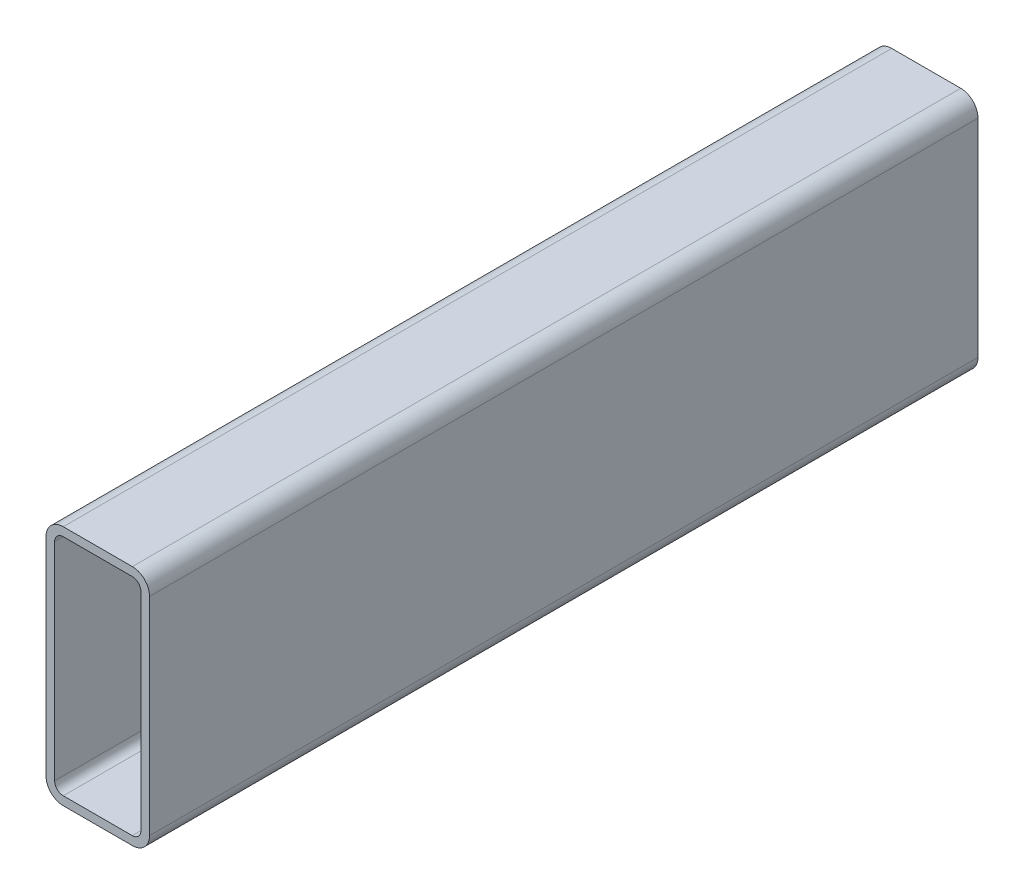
ISO-10303-21;
HEADER;
FILE_DESCRIPTION(('STEP AP214'),'2;1');
FILE_NAME('part.step','',(''),(''),'','','');
FILE_SCHEMA(('AUTOMOTIVE_DESIGN { 1 0 10303 214 1 1 1 1 }'));
ENDSEC;
DATA;
#1=APPLICATION_CONTEXT('core data for automotive mechanical design processes');
#2=APPLICATION_PROTOCOL_DEFINITION('international standard','automotive_design',2000,#1);
#3=PRODUCT_CONTEXT('',#1,'mechanical');
#4=PRODUCT('Part','Part','',(#3));
#5=PRODUCT_RELATED_PRODUCT_CATEGORY('part','',(#4));
#6=PRODUCT_DEFINITION_FORMATION('','',#4);
#7=PRODUCT_DEFINITION_CONTEXT('part definition',#1,'design');
#8=PRODUCT_DEFINITION('design','',#6,#7);
#9=PRODUCT_DEFINITION_SHAPE('','',#8);
#10=(LENGTH_UNIT() NAMED_UNIT(*) SI_UNIT(.MILLI.,.METRE.));
#11=(NAMED_UNIT(*) PLANE_ANGLE_UNIT() SI_UNIT($,.RADIAN.));
#12=(NAMED_UNIT(*) SI_UNIT($,.STERADIAN.) SOLID_ANGLE_UNIT());
#13=UNCERTAINTY_MEASURE_WITH_UNIT(LENGTH_MEASURE(1.E-05),#10,'distance_accuracy_value','');
#14=(GEOMETRIC_REPRESENTATION_CONTEXT(3) GLOBAL_UNCERTAINTY_ASSIGNED_CONTEXT((#13)) GLOBAL_UNIT_ASSIGNED_CONTEXT((#10,
#11,#12)) REPRESENTATION_CONTEXT('',''));
#15=CARTESIAN_POINT('',(0.,0.,0.));
#16=DIRECTION('',(0.,0.,1.));
#17=DIRECTION('',(1.,0.,0.));
#18=AXIS2_PLACEMENT_3D('',#15,#16,#17);
#19=CARTESIAN_POINT('',(6.35,82.55,304.8));
#20=DIRECTION('',(0.,0.,1.));
#21=DIRECTION('',(1.,0.,0.));
#22=AXIS2_PLACEMENT_3D('',#19,#20,#21);
#23=PLANE('',#22);
#24=CARTESIAN_POINT('',(6.35,82.55,304.8));
#25=DIRECTION('',(0.,0.,1.));
#26=DIRECTION('',(1.,0.,0.));
#27=AXIS2_PLACEMENT_3D('',#24,#25,#26);
#28=CIRCLE('',#27,6.35);
#29=CARTESIAN_POINT('',(6.35,88.9,304.8));
#30=VERTEX_POINT('',#29);
#31=CARTESIAN_POINT('',(0.,82.55,304.8));
#32=VERTEX_POINT('',#31);
#33=EDGE_CURVE('E211',#30,#32,#28,.T.);
#34=ORIENTED_EDGE('',*,*,#33,.T.);
#35=DIRECTION('',(0.,-1.,0.));
#36=VECTOR('',#35,1.);
#37=CARTESIAN_POINT('',(0.,6.35,304.8));
#38=LINE('',#37,#36);
#39=CARTESIAN_POINT('',(0.,6.35,304.8));
#40=VERTEX_POINT('',#39);
#41=EDGE_CURVE('E214',#32,#40,#38,.T.);
#42=ORIENTED_EDGE('',*,*,#41,.T.);
#43=CARTESIAN_POINT('',(6.35,6.35,304.8));
#44=DIRECTION('',(0.,0.,1.));
#45=DIRECTION('',(1.,0.,0.));
#46=AXIS2_PLACEMENT_3D('',#43,#44,#45);
#47=CIRCLE('',#46,6.35);
#48=CARTESIAN_POINT('',(6.35,0.,304.8));
#49=VERTEX_POINT('',#48);
#50=EDGE_CURVE('E217',#40,#49,#47,.T.);
#51=ORIENTED_EDGE('',*,*,#50,.T.);
#52=DIRECTION('',(1.,0.,0.));
#53=VECTOR('',#52,1.);
#54=CARTESIAN_POINT('',(31.75,0.,304.8));
#55=LINE('',#54,#53);
#56=CARTESIAN_POINT('',(31.75,0.,304.8));
#57=VERTEX_POINT('',#56);
#58=EDGE_CURVE('E219',#49,#57,#55,.T.);
#59=ORIENTED_EDGE('',*,*,#58,.T.);
#60=CARTESIAN_POINT('',(31.75,6.35,304.8));
#61=DIRECTION('',(0.,0.,1.));
#62=DIRECTION('',(1.,0.,0.));
#63=AXIS2_PLACEMENT_3D('',#60,#61,#62);
#64=CIRCLE('',#63,6.35);
#65=CARTESIAN_POINT('',(38.1,6.35,304.8));
#66=VERTEX_POINT('',#65);
#67=EDGE_CURVE('E221',#57,#66,#64,.T.);
#68=ORIENTED_EDGE('',*,*,#67,.T.);
#69=DIRECTION('',(0.,1.,0.));
#70=VECTOR('',#69,1.);
#71=CARTESIAN_POINT('',(38.1,82.55,304.8));
#72=LINE('',#71,#70);
#73=CARTESIAN_POINT('',(38.1,82.55,304.8));
#74=VERTEX_POINT('',#73);
#75=EDGE_CURVE('E223',#66,#74,#72,.T.);
#76=ORIENTED_EDGE('',*,*,#75,.T.);
#77=CARTESIAN_POINT('',(31.75,82.55,304.8));
#78=DIRECTION('',(0.,0.,1.));
#79=DIRECTION('',(1.,0.,0.));
#80=AXIS2_PLACEMENT_3D('',#77,#78,#79);
#81=CIRCLE('',#80,6.35);
#82=CARTESIAN_POINT('',(31.75,88.9,304.8));
#83=VERTEX_POINT('',#82);
#84=EDGE_CURVE('E225',#74,#83,#81,.T.);
#85=ORIENTED_EDGE('',*,*,#84,.T.);
#86=DIRECTION('',(-1.,0.,0.));
#87=VECTOR('',#86,1.);
#88=CARTESIAN_POINT('',(6.35,88.9,304.8));
#89=LINE('',#88,#87);
#90=EDGE_CURVE('E227',#83,#30,#89,.T.);
#91=ORIENTED_EDGE('',*,*,#90,.T.);
#92=EDGE_LOOP('',(#34,#42,#51,#59,#68,#76,#85,#91));
#93=FACE_BOUND('',#92,.T.);
#94=DIRECTION('',(0.,-1.,0.));
#95=VECTOR('',#94,1.);
#96=CARTESIAN_POINT('',(3.175,6.35,304.8));
#97=LINE('',#96,#95);
#98=CARTESIAN_POINT('',(3.175,82.55,304.8));
#99=VERTEX_POINT('',#98);
#100=CARTESIAN_POINT('',(3.175,6.35,304.8));
#101=VERTEX_POINT('',#100);
#102=EDGE_CURVE('E154',#99,#101,#97,.T.);
#103=ORIENTED_EDGE('',*,*,#102,.F.);
#104=CARTESIAN_POINT('',(6.35,82.55,304.8));
#105=DIRECTION('',(0.,0.,1.));
#106=DIRECTION('',(1.,0.,0.));
#107=AXIS2_PLACEMENT_3D('',#104,#105,#106);
#108=CIRCLE('',#107,3.175);
#109=CARTESIAN_POINT('',(6.35,85.725,304.8));
#110=VERTEX_POINT('',#109);
#111=EDGE_CURVE('E146',#110,#99,#108,.T.);
#112=ORIENTED_EDGE('',*,*,#111,.F.);
#113=DIRECTION('',(-1.,0.,0.));
#114=VECTOR('',#113,1.);
#115=CARTESIAN_POINT('',(6.35,85.725,304.8));
#116=LINE('',#115,#114);
#117=CARTESIAN_POINT('',(31.75,85.725,304.8));
#118=VERTEX_POINT('',#117);
#119=EDGE_CURVE('E179',#118,#110,#116,.T.);
#120=ORIENTED_EDGE('',*,*,#119,.F.);
#121=CARTESIAN_POINT('',(31.75,82.55,304.8));
#122=DIRECTION('',(0.,0.,1.));
#123=DIRECTION('',(1.,0.,0.));
#124=AXIS2_PLACEMENT_3D('',#121,#122,#123);
#125=CIRCLE('',#124,3.175);
#126=CARTESIAN_POINT('',(34.925,82.55,304.8));
#127=VERTEX_POINT('',#126);
#128=EDGE_CURVE('E177',#127,#118,#125,.T.);
#129=ORIENTED_EDGE('',*,*,#128,.F.);
#130=DIRECTION('',(0.,1.,0.));
#131=VECTOR('',#130,1.);
#132=CARTESIAN_POINT('',(34.925,82.55,304.8));
#133=LINE('',#132,#131);
#134=CARTESIAN_POINT('',(34.925,6.35,304.8));
#135=VERTEX_POINT('',#134);
#136=EDGE_CURVE('E175',#135,#127,#133,.T.);
#137=ORIENTED_EDGE('',*,*,#136,.F.);
#138=CARTESIAN_POINT('',(31.75,6.35,304.8));
#139=DIRECTION('',(0.,0.,1.));
#140=DIRECTION('',(1.,0.,0.));
#141=AXIS2_PLACEMENT_3D('',#138,#139,#140);
#142=CIRCLE('',#141,3.175);
#143=CARTESIAN_POINT('',(31.75,3.175,304.8));
#144=VERTEX_POINT('',#143);
#145=EDGE_CURVE('E173',#144,#135,#142,.T.);
#146=ORIENTED_EDGE('',*,*,#145,.F.);
#147=DIRECTION('',(1.,0.,0.));
#148=VECTOR('',#147,1.);
#149=CARTESIAN_POINT('',(31.75,3.175,304.8));
#150=LINE('',#149,#148);
#151=CARTESIAN_POINT('',(6.35,3.175,304.8));
#152=VERTEX_POINT('',#151);
#153=EDGE_CURVE('E169',#152,#144,#150,.T.);
#154=ORIENTED_EDGE('',*,*,#153,.F.);
#155=CARTESIAN_POINT('',(6.35,6.35,304.8));
#156=DIRECTION('',(0.,0.,1.));
#157=DIRECTION('',(1.,0.,0.));
#158=AXIS2_PLACEMENT_3D('',#155,#156,#157);
#159=CIRCLE('',#158,3.175);
#160=EDGE_CURVE('E167',#101,#152,#159,.T.);
#161=ORIENTED_EDGE('',*,*,#160,.F.);
#162=EDGE_LOOP('',(#103,#112,#120,#129,#137,#146,#154,#161));
#163=FACE_BOUND('',#162,.T.);
#164=ADVANCED_FACE('F33',(#93,#163),#23,.T.);
#165=CARTESIAN_POINT('',(6.35,82.55,0.));
#166=DIRECTION('',(0.,0.,1.));
#167=DIRECTION('',(1.,0.,0.));
#168=AXIS2_PLACEMENT_3D('',#165,#166,#167);
#169=PLANE('',#168);
#170=CARTESIAN_POINT('',(6.35,82.55,0.));
#171=DIRECTION('',(0.,0.,1.));
#172=DIRECTION('',(1.,0.,0.));
#173=AXIS2_PLACEMENT_3D('',#170,#171,#172);
#174=CIRCLE('',#173,6.35);
#175=CARTESIAN_POINT('',(6.35,88.9,0.));
#176=VERTEX_POINT('',#175);
#177=CARTESIAN_POINT('',(0.,82.55,0.));
#178=VERTEX_POINT('',#177);
#179=EDGE_CURVE('E162',#176,#178,#174,.T.);
#180=ORIENTED_EDGE('',*,*,#179,.F.);
#181=DIRECTION('',(-1.,0.,0.));
#182=VECTOR('',#181,1.);
#183=CARTESIAN_POINT('',(6.35,88.9,0.));
#184=LINE('',#183,#182);
#185=CARTESIAN_POINT('',(31.75,88.9,0.));
#186=VERTEX_POINT('',#185);
#187=EDGE_CURVE('E215',#186,#176,#184,.T.);
#188=ORIENTED_EDGE('',*,*,#187,.F.);
#189=CARTESIAN_POINT('',(31.75,82.55,0.));
#190=DIRECTION('',(0.,0.,1.));
#191=DIRECTION('',(1.,0.,0.));
#192=AXIS2_PLACEMENT_3D('',#189,#190,#191);
#193=CIRCLE('',#192,6.35);
#194=CARTESIAN_POINT('',(38.1,82.55,0.));
#195=VERTEX_POINT('',#194);
#196=EDGE_CURVE('E242',#195,#186,#193,.T.);
#197=ORIENTED_EDGE('',*,*,#196,.F.);
#198=DIRECTION('',(0.,1.,0.));
#199=VECTOR('',#198,1.);
#200=CARTESIAN_POINT('',(38.1,82.55,0.));
#201=LINE('',#200,#199);
#202=CARTESIAN_POINT('',(38.1,6.35,0.));
#203=VERTEX_POINT('',#202);
#204=EDGE_CURVE('E240',#203,#195,#201,.T.);
#205=ORIENTED_EDGE('',*,*,#204,.F.);
#206=CARTESIAN_POINT('',(31.75,6.35,0.));
#207=DIRECTION('',(0.,0.,1.));
#208=DIRECTION('',(1.,0.,0.));
#209=AXIS2_PLACEMENT_3D('',#206,#207,#208);
#210=CIRCLE('',#209,6.35);
#211=CARTESIAN_POINT('',(31.75,0.,0.));
#212=VERTEX_POINT('',#211);
#213=EDGE_CURVE('E238',#212,#203,#210,.T.);
#214=ORIENTED_EDGE('',*,*,#213,.F.);
#215=DIRECTION('',(1.,0.,0.));
#216=VECTOR('',#215,1.);
#217=CARTESIAN_POINT('',(31.75,0.,0.));
#218=LINE('',#217,#216);
#219=CARTESIAN_POINT('',(6.35,0.,0.));
#220=VERTEX_POINT('',#219);
#221=EDGE_CURVE('E236',#220,#212,#218,.T.);
#222=ORIENTED_EDGE('',*,*,#221,.F.);
#223=CARTESIAN_POINT('',(6.35,6.35,0.));
#224=DIRECTION('',(0.,0.,1.));
#225=DIRECTION('',(1.,0.,0.));
#226=AXIS2_PLACEMENT_3D('',#223,#224,#225);
#227=CIRCLE('',#226,6.35);
#228=CARTESIAN_POINT('',(0.,6.35,0.));
#229=VERTEX_POINT('',#228);
#230=EDGE_CURVE('E234',#229,#220,#227,.T.);
#231=ORIENTED_EDGE('',*,*,#230,.F.);
#232=DIRECTION('',(0.,-1.,0.));
#233=VECTOR('',#232,1.);
#234=CARTESIAN_POINT('',(0.,6.35,0.));
#235=LINE('',#234,#233);
#236=EDGE_CURVE('E232',#178,#229,#235,.T.);
#237=ORIENTED_EDGE('',*,*,#236,.F.);
#238=EDGE_LOOP('',(#180,#188,#197,#205,#214,#222,#231,#237));
#239=FACE_BOUND('',#238,.T.);
#240=CARTESIAN_POINT('',(6.35,82.55,0.));
#241=DIRECTION('',(0.,0.,1.));
#242=DIRECTION('',(1.,0.,0.));
#243=AXIS2_PLACEMENT_3D('',#240,#241,#242);
#244=CIRCLE('',#243,3.175);
#245=CARTESIAN_POINT('',(6.35,85.725,0.));
#246=VERTEX_POINT('',#245);
#247=CARTESIAN_POINT('',(3.175,82.55,0.));
#248=VERTEX_POINT('',#247);
#249=EDGE_CURVE('E56',#246,#248,#244,.T.);
#250=ORIENTED_EDGE('',*,*,#249,.T.);
#251=DIRECTION('',(0.,-1.,0.));
#252=VECTOR('',#251,1.);
#253=CARTESIAN_POINT('',(3.175,6.35,0.));
#254=LINE('',#253,#252);
#255=CARTESIAN_POINT('',(3.175,6.35,0.));
#256=VERTEX_POINT('',#255);
#257=EDGE_CURVE('E161',#248,#256,#254,.T.);
#258=ORIENTED_EDGE('',*,*,#257,.T.);
#259=CARTESIAN_POINT('',(6.35,6.35,0.));
#260=DIRECTION('',(0.,0.,1.));
#261=DIRECTION('',(1.,0.,0.));
#262=AXIS2_PLACEMENT_3D('',#259,#260,#261);
#263=CIRCLE('',#262,3.175);
#264=CARTESIAN_POINT('',(6.35,3.175,0.));
#265=VERTEX_POINT('',#264);
#266=EDGE_CURVE('E183',#256,#265,#263,.T.);
#267=ORIENTED_EDGE('',*,*,#266,.T.);
#268=DIRECTION('',(1.,0.,0.));
#269=VECTOR('',#268,1.);
#270=CARTESIAN_POINT('',(31.75,3.175,0.));
#271=LINE('',#270,#269);
#272=CARTESIAN_POINT('',(31.75,3.175,0.));
#273=VERTEX_POINT('',#272);
#274=EDGE_CURVE('E186',#265,#273,#271,.T.);
#275=ORIENTED_EDGE('',*,*,#274,.T.);
#276=CARTESIAN_POINT('',(31.75,6.35,0.));
#277=DIRECTION('',(0.,0.,1.));
#278=DIRECTION('',(1.,0.,0.));
#279=AXIS2_PLACEMENT_3D('',#276,#277,#278);
#280=CIRCLE('',#279,3.175);
#281=CARTESIAN_POINT('',(34.925,6.35,0.));
#282=VERTEX_POINT('',#281);
#283=EDGE_CURVE('E189',#273,#282,#280,.T.);
#284=ORIENTED_EDGE('',*,*,#283,.T.);
#285=DIRECTION('',(0.,1.,0.));
#286=VECTOR('',#285,1.);
#287=CARTESIAN_POINT('',(34.925,82.55,0.));
#288=LINE('',#287,#286);
#289=CARTESIAN_POINT('',(34.925,82.55,0.));
#290=VERTEX_POINT('',#289);
#291=EDGE_CURVE('E192',#282,#290,#288,.T.);
#292=ORIENTED_EDGE('',*,*,#291,.T.);
#293=CARTESIAN_POINT('',(31.75,82.55,0.));
#294=DIRECTION('',(0.,0.,1.));
#295=DIRECTION('',(1.,0.,0.));
#296=AXIS2_PLACEMENT_3D('',#293,#294,#295);
#297=CIRCLE('',#296,3.175);
#298=CARTESIAN_POINT('',(31.75,85.725,0.));
#299=VERTEX_POINT('',#298);
#300=EDGE_CURVE('E195',#290,#299,#297,.T.);
#301=ORIENTED_EDGE('',*,*,#300,.T.);
#302=DIRECTION('',(-1.,0.,0.));
#303=VECTOR('',#302,1.);
#304=CARTESIAN_POINT('',(6.35,85.725,0.));
#305=LINE('',#304,#303);
#306=EDGE_CURVE('E155',#299,#246,#305,.T.);
#307=ORIENTED_EDGE('',*,*,#306,.T.);
#308=EDGE_LOOP('',(#250,#258,#267,#275,#284,#292,#301,#307));
#309=FACE_BOUND('',#308,.T.);
#310=ADVANCED_FACE('F272',(#239,#309),#169,.F.);
#311=CARTESIAN_POINT('',(6.35,82.55,304.8));
#312=DIRECTION('',(0.,0.,-1.));
#313=DIRECTION('',(-1.,0.,0.));
#314=AXIS2_PLACEMENT_3D('',#311,#312,#313);
#315=CYLINDRICAL_SURFACE('',#314,6.35);
#316=ORIENTED_EDGE('',*,*,#179,.T.);
#317=DIRECTION('',(0.,0.,-1.));
#318=VECTOR('',#317,1.);
#319=CARTESIAN_POINT('',(0.,82.55,304.8));
#320=LINE('',#319,#318);
#321=EDGE_CURVE('E11',#32,#178,#320,.T.);
#322=ORIENTED_EDGE('',*,*,#321,.F.);
#323=ORIENTED_EDGE('',*,*,#33,.F.);
#324=DIRECTION('',(0.,0.,-1.));
#325=VECTOR('',#324,1.);
#326=CARTESIAN_POINT('',(6.35,88.9,304.8));
#327=LINE('',#326,#325);
#328=EDGE_CURVE('E229',#30,#176,#327,.T.);
#329=ORIENTED_EDGE('',*,*,#328,.T.);
#330=EDGE_LOOP('',(#316,#322,#323,#329));
#331=FACE_BOUND('',#330,.T.);
#332=ADVANCED_FACE('F35',(#331),#315,.T.);
#333=CARTESIAN_POINT('',(0.,6.35,304.8));
#334=DIRECTION('',(1.,0.,0.));
#335=DIRECTION('',(0.,0.,-1.));
#336=AXIS2_PLACEMENT_3D('',#333,#334,#335);
#337=PLANE('',#336);
#338=ORIENTED_EDGE('',*,*,#236,.T.);
#339=DIRECTION('',(0.,0.,-1.));
#340=VECTOR('',#339,1.);
#341=CARTESIAN_POINT('',(0.,6.35,304.8));
#342=LINE('',#341,#340);
#343=EDGE_CURVE('E41',#40,#229,#342,.T.);
#344=ORIENTED_EDGE('',*,*,#343,.F.);
#345=ORIENTED_EDGE('',*,*,#41,.F.);
#346=ORIENTED_EDGE('',*,*,#321,.T.);
#347=EDGE_LOOP('',(#338,#344,#345,#346));
#348=FACE_BOUND('',#347,.T.);
#349=ADVANCED_FACE('F289',(#348),#337,.F.);
#350=CARTESIAN_POINT('',(6.35,6.35,304.8));
#351=DIRECTION('',(0.,0.,-1.));
#352=DIRECTION('',(-1.,0.,0.));
#353=AXIS2_PLACEMENT_3D('',#350,#351,#352);
#354=CYLINDRICAL_SURFACE('',#353,6.35);
#355=ORIENTED_EDGE('',*,*,#230,.T.);
#356=DIRECTION('',(0.,0.,-1.));
#357=VECTOR('',#356,1.);
#358=CARTESIAN_POINT('',(6.35,0.,304.8));
#359=LINE('',#358,#357);
#360=EDGE_CURVE('E259',#49,#220,#359,.T.);
#361=ORIENTED_EDGE('',*,*,#360,.F.);
#362=ORIENTED_EDGE('',*,*,#50,.F.);
#363=ORIENTED_EDGE('',*,*,#343,.T.);
#364=EDGE_LOOP('',(#355,#361,#362,#363));
#365=FACE_BOUND('',#364,.T.);
#366=ADVANCED_FACE('F266',(#365),#354,.T.);
#367=CARTESIAN_POINT('',(31.75,0.,304.8));
#368=DIRECTION('',(0.,1.,0.));
#369=DIRECTION('',(0.,0.,1.));
#370=AXIS2_PLACEMENT_3D('',#367,#368,#369);
#371=PLANE('',#370);
#372=ORIENTED_EDGE('',*,*,#221,.T.);
#373=DIRECTION('',(0.,0.,-1.));
#374=VECTOR('',#373,1.);
#375=CARTESIAN_POINT('',(31.75,0.,304.8));
#376=LINE('',#375,#374);
#377=EDGE_CURVE('E256',#57,#212,#376,.T.);
#378=ORIENTED_EDGE('',*,*,#377,.F.);
#379=ORIENTED_EDGE('',*,*,#58,.F.);
#380=ORIENTED_EDGE('',*,*,#360,.T.);
#381=EDGE_LOOP('',(#372,#378,#379,#380));
#382=FACE_BOUND('',#381,.T.);
#383=ADVANCED_FACE('F278',(#382),#371,.F.);
#384=CARTESIAN_POINT('',(31.75,6.35,304.8));
#385=DIRECTION('',(0.,0.,-1.));
#386=DIRECTION('',(-1.,0.,0.));
#387=AXIS2_PLACEMENT_3D('',#384,#385,#386);
#388=CYLINDRICAL_SURFACE('',#387,6.35);
#389=ORIENTED_EDGE('',*,*,#213,.T.);
#390=DIRECTION('',(0.,0.,-1.));
#391=VECTOR('',#390,1.);
#392=CARTESIAN_POINT('',(38.1,6.35,304.8));
#393=LINE('',#392,#391);
#394=EDGE_CURVE('E253',#66,#203,#393,.T.);
#395=ORIENTED_EDGE('',*,*,#394,.F.);
#396=ORIENTED_EDGE('',*,*,#67,.F.);
#397=ORIENTED_EDGE('',*,*,#377,.T.);
#398=EDGE_LOOP('',(#389,#395,#396,#397));
#399=FACE_BOUND('',#398,.T.);
#400=ADVANCED_FACE('F282',(#399),#388,.T.);
#401=CARTESIAN_POINT('',(38.1,82.55,304.8));
#402=DIRECTION('',(-1.,0.,0.));
#403=DIRECTION('',(0.,0.,1.));
#404=AXIS2_PLACEMENT_3D('',#401,#402,#403);
#405=PLANE('',#404);
#406=ORIENTED_EDGE('',*,*,#204,.T.);
#407=DIRECTION('',(0.,0.,-1.));
#408=VECTOR('',#407,1.);
#409=CARTESIAN_POINT('',(38.1,82.55,304.8));
#410=LINE('',#409,#408);
#411=EDGE_CURVE('E250',#74,#195,#410,.T.);
#412=ORIENTED_EDGE('',*,*,#411,.F.);
#413=ORIENTED_EDGE('',*,*,#75,.F.);
#414=ORIENTED_EDGE('',*,*,#394,.T.);
#415=EDGE_LOOP('',(#406,#412,#413,#414));
#416=FACE_BOUND('',#415,.T.);
#417=ADVANCED_FACE('F302',(#416),#405,.F.);
#418=CARTESIAN_POINT('',(31.75,82.55,304.8));
#419=DIRECTION('',(0.,0.,-1.));
#420=DIRECTION('',(-1.,0.,0.));
#421=AXIS2_PLACEMENT_3D('',#418,#419,#420);
#422=CYLINDRICAL_SURFACE('',#421,6.35);
#423=ORIENTED_EDGE('',*,*,#196,.T.);
#424=DIRECTION('',(0.,0.,-1.));
#425=VECTOR('',#424,1.);
#426=CARTESIAN_POINT('',(31.75,88.9,304.8));
#427=LINE('',#426,#425);
#428=EDGE_CURVE('E247',#83,#186,#427,.T.);
#429=ORIENTED_EDGE('',*,*,#428,.F.);
#430=ORIENTED_EDGE('',*,*,#84,.F.);
#431=ORIENTED_EDGE('',*,*,#411,.T.);
#432=EDGE_LOOP('',(#423,#429,#430,#431));
#433=FACE_BOUND('',#432,.T.);
#434=ADVANCED_FACE('F300',(#433),#422,.T.);
#435=CARTESIAN_POINT('',(6.35,88.9,304.8));
#436=DIRECTION('',(0.,-1.,0.));
#437=DIRECTION('',(0.,0.,-1.));
#438=AXIS2_PLACEMENT_3D('',#435,#436,#437);
#439=PLANE('',#438);
#440=ORIENTED_EDGE('',*,*,#187,.T.);
#441=ORIENTED_EDGE('',*,*,#328,.F.);
#442=ORIENTED_EDGE('',*,*,#90,.F.);
#443=ORIENTED_EDGE('',*,*,#428,.T.);
#444=EDGE_LOOP('',(#440,#441,#442,#443));
#445=FACE_BOUND('',#444,.T.);
#446=ADVANCED_FACE('F295',(#445),#439,.F.);
#447=CARTESIAN_POINT('',(6.35,82.55,304.8));
#448=DIRECTION('',(0.,0.,-1.));
#449=DIRECTION('',(-1.,0.,0.));
#450=AXIS2_PLACEMENT_3D('',#447,#448,#449);
#451=CYLINDRICAL_SURFACE('',#450,3.175);
#452=ORIENTED_EDGE('',*,*,#249,.F.);
#453=DIRECTION('',(0.,0.,-1.));
#454=VECTOR('',#453,1.);
#455=CARTESIAN_POINT('',(6.35,85.725,304.8));
#456=LINE('',#455,#454);
#457=EDGE_CURVE('E150',#110,#246,#456,.T.);
#458=ORIENTED_EDGE('',*,*,#457,.F.);
#459=ORIENTED_EDGE('',*,*,#111,.T.);
#460=DIRECTION('',(0.,0.,-1.));
#461=VECTOR('',#460,1.);
#462=CARTESIAN_POINT('',(3.175,82.55,304.8));
#463=LINE('',#462,#461);
#464=EDGE_CURVE('E149',#99,#248,#463,.T.);
#465=ORIENTED_EDGE('',*,*,#464,.T.);
#466=EDGE_LOOP('',(#452,#458,#459,#465));
#467=FACE_BOUND('',#466,.T.);
#468=ADVANCED_FACE('F148',(#467),#451,.F.);
#469=CARTESIAN_POINT('',(3.175,6.35,304.8));
#470=DIRECTION('',(1.,0.,0.));
#471=DIRECTION('',(0.,0.,-1.));
#472=AXIS2_PLACEMENT_3D('',#469,#470,#471);
#473=PLANE('',#472);
#474=ORIENTED_EDGE('',*,*,#257,.F.);
#475=ORIENTED_EDGE('',*,*,#464,.F.);
#476=ORIENTED_EDGE('',*,*,#102,.T.);
#477=DIRECTION('',(0.,0.,-1.));
#478=VECTOR('',#477,1.);
#479=CARTESIAN_POINT('',(3.175,6.35,304.8));
#480=LINE('',#479,#478);
#481=EDGE_CURVE('E163',#101,#256,#480,.T.);
#482=ORIENTED_EDGE('',*,*,#481,.T.);
#483=EDGE_LOOP('',(#474,#475,#476,#482));
#484=FACE_BOUND('',#483,.T.);
#485=ADVANCED_FACE('F158',(#484),#473,.T.);
#486=CARTESIAN_POINT('',(6.35,6.35,304.8));
#487=DIRECTION('',(0.,0.,-1.));
#488=DIRECTION('',(-1.,0.,0.));
#489=AXIS2_PLACEMENT_3D('',#486,#487,#488);
#490=CYLINDRICAL_SURFACE('',#489,3.175);
#491=ORIENTED_EDGE('',*,*,#266,.F.);
#492=ORIENTED_EDGE('',*,*,#481,.F.);
#493=ORIENTED_EDGE('',*,*,#160,.T.);
#494=DIRECTION('',(0.,0.,-1.));
#495=VECTOR('',#494,1.);
#496=CARTESIAN_POINT('',(6.35,3.175,304.8));
#497=LINE('',#496,#495);
#498=EDGE_CURVE('E208',#152,#265,#497,.T.);
#499=ORIENTED_EDGE('',*,*,#498,.T.);
#500=EDGE_LOOP('',(#491,#492,#493,#499));
#501=FACE_BOUND('',#500,.T.);
#502=ADVANCED_FACE('F327',(#501),#490,.F.);
#503=CARTESIAN_POINT('',(31.75,3.175,304.8));
#504=DIRECTION('',(0.,1.,0.));
#505=DIRECTION('',(0.,0.,1.));
#506=AXIS2_PLACEMENT_3D('',#503,#504,#505);
#507=PLANE('',#506);
#508=ORIENTED_EDGE('',*,*,#274,.F.);
#509=ORIENTED_EDGE('',*,*,#498,.F.);
#510=ORIENTED_EDGE('',*,*,#153,.T.);
#511=DIRECTION('',(0.,0.,-1.));
#512=VECTOR('',#511,1.);
#513=CARTESIAN_POINT('',(31.75,3.175,304.8));
#514=LINE('',#513,#512);
#515=EDGE_CURVE('E206',#144,#273,#514,.T.);
#516=ORIENTED_EDGE('',*,*,#515,.T.);
#517=EDGE_LOOP('',(#508,#509,#510,#516));
#518=FACE_BOUND('',#517,.T.);
#519=ADVANCED_FACE('F331',(#518),#507,.T.);
#520=CARTESIAN_POINT('',(31.75,6.35,304.8));
#521=DIRECTION('',(0.,0.,-1.));
#522=DIRECTION('',(-1.,0.,0.));
#523=AXIS2_PLACEMENT_3D('',#520,#521,#522);
#524=CYLINDRICAL_SURFACE('',#523,3.175);
#525=ORIENTED_EDGE('',*,*,#283,.F.);
#526=ORIENTED_EDGE('',*,*,#515,.F.);
#527=ORIENTED_EDGE('',*,*,#145,.T.);
#528=DIRECTION('',(0.,0.,-1.));
#529=VECTOR('',#528,1.);
#530=CARTESIAN_POINT('',(34.925,6.35,304.8));
#531=LINE('',#530,#529);
#532=EDGE_CURVE('E204',#135,#282,#531,.T.);
#533=ORIENTED_EDGE('',*,*,#532,.T.);
#534=EDGE_LOOP('',(#525,#526,#527,#533));
#535=FACE_BOUND('',#534,.T.);
#536=ADVANCED_FACE('F337',(#535),#524,.F.);
#537=CARTESIAN_POINT('',(34.925,82.55,304.8));
#538=DIRECTION('',(-1.,0.,0.));
#539=DIRECTION('',(0.,0.,1.));
#540=AXIS2_PLACEMENT_3D('',#537,#538,#539);
#541=PLANE('',#540);
#542=ORIENTED_EDGE('',*,*,#291,.F.);
#543=ORIENTED_EDGE('',*,*,#532,.F.);
#544=ORIENTED_EDGE('',*,*,#136,.T.);
#545=DIRECTION('',(0.,0.,-1.));
#546=VECTOR('',#545,1.);
#547=CARTESIAN_POINT('',(34.925,82.55,304.8));
#548=LINE('',#547,#546);
#549=EDGE_CURVE('E202',#127,#290,#548,.T.);
#550=ORIENTED_EDGE('',*,*,#549,.T.);
#551=EDGE_LOOP('',(#542,#543,#544,#550));
#552=FACE_BOUND('',#551,.T.);
#553=ADVANCED_FACE('F341',(#552),#541,.T.);
#554=CARTESIAN_POINT('',(31.75,82.55,304.8));
#555=DIRECTION('',(0.,0.,-1.));
#556=DIRECTION('',(-1.,0.,0.));
#557=AXIS2_PLACEMENT_3D('',#554,#555,#556);
#558=CYLINDRICAL_SURFACE('',#557,3.175);
#559=ORIENTED_EDGE('',*,*,#300,.F.);
#560=ORIENTED_EDGE('',*,*,#549,.F.);
#561=ORIENTED_EDGE('',*,*,#128,.T.);
#562=DIRECTION('',(0.,0.,-1.));
#563=VECTOR('',#562,1.);
#564=CARTESIAN_POINT('',(31.75,85.725,304.8));
#565=LINE('',#564,#563);
#566=EDGE_CURVE('E48',#118,#299,#565,.T.);
#567=ORIENTED_EDGE('',*,*,#566,.T.);
#568=EDGE_LOOP('',(#559,#560,#561,#567));
#569=FACE_BOUND('',#568,.T.);
#570=ADVANCED_FACE('F345',(#569),#558,.F.);
#571=CARTESIAN_POINT('',(6.35,85.725,304.8));
#572=DIRECTION('',(0.,-1.,0.));
#573=DIRECTION('',(0.,0.,-1.));
#574=AXIS2_PLACEMENT_3D('',#571,#572,#573);
#575=PLANE('',#574);
#576=ORIENTED_EDGE('',*,*,#306,.F.);
#577=ORIENTED_EDGE('',*,*,#566,.F.);
#578=ORIENTED_EDGE('',*,*,#119,.T.);
#579=ORIENTED_EDGE('',*,*,#457,.T.);
#580=EDGE_LOOP('',(#576,#577,#578,#579));
#581=FACE_BOUND('',#580,.T.);
#582=ADVANCED_FACE('F349',(#581),#575,.T.);
#583=CLOSED_SHELL('',(#164,#310,#332,#349,#366,#383,#400,#417,#434,#446,#468,#485,#502,#519,
#536,#553,#570,#582));
#584=MANIFOLD_SOLID_BREP('B2',#583);
#585=ADVANCED_BREP_SHAPE_REPRESENTATION('',(#18,#584),#14);
#586=SHAPE_DEFINITION_REPRESENTATION(#9,#585);
ENDSEC;
END-ISO-10303-21;
